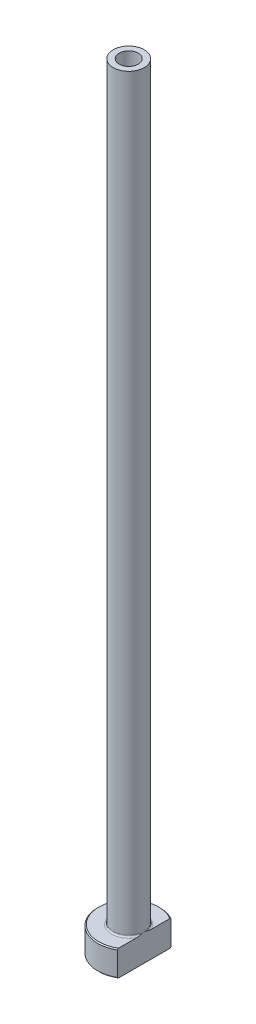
from build123d import *

# Parameters (mm, degrees)
FILLET1_R          = 0.3
CHAMFER1_SIZE      = 0.2
CUT_EXTRUDE1_DEPTH = 151.239808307
CHAMFER2_SIZE      = 0.5


with BuildPart() as part:
    # Sketch1 → Revolve1 (revolve)
    with BuildSketch(Plane.XY, mode=Mode.PRIVATE) as revolve1_sk:
        Polygon((-1.85, 150), (-3, 150), (-3, 5), (-6, 5), (-6, 0), (-2.1, 0), (-2.1, 93), (-1.85, 105), align=None)
    revolve(revolve1_sk.sketch.rotate(Axis((0, 92.187680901, 0), (0, -1, 0)), 270), axis=Axis((0, 92.187680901, 0), (0, -1, 0)))

    # Fillet1
    fillet1_edges = [part.edges().sort_by_distance(p)[0] for p in [
        (0, 5, -3),
    ]]
    fillet(fillet1_edges, radius=FILLET1_R)

    # Chamfer1
    chamfer1_edges = [part.edges().sort_by_distance(p)[0] for p in [
        (0, 0, -6),
        (0, 5, -6),
    ]]
    chamfer(chamfer1_edges, length=CHAMFER1_SIZE)

    # Sketch2 → Cut-Extrude1 (cut, through all)
    with BuildSketch(Plane.XZ):
        with BuildLine():
            Line((3, 5.196152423), (3, -5.196152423))
            ThreePointArc((3, -5.196152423), (6, 0), (3, 5.196152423))
        make_face()
    extrude(amount=-CUT_EXTRUDE1_DEPTH, mode=Mode.SUBTRACT)

    # Chamfer2
    chamfer2_edges = [part.edges().sort_by_distance(p)[0] for p in [
        (0, 0, -2.1),
    ]]
    chamfer(chamfer2_edges, length=CHAMFER2_SIZE)


solid = part.part
